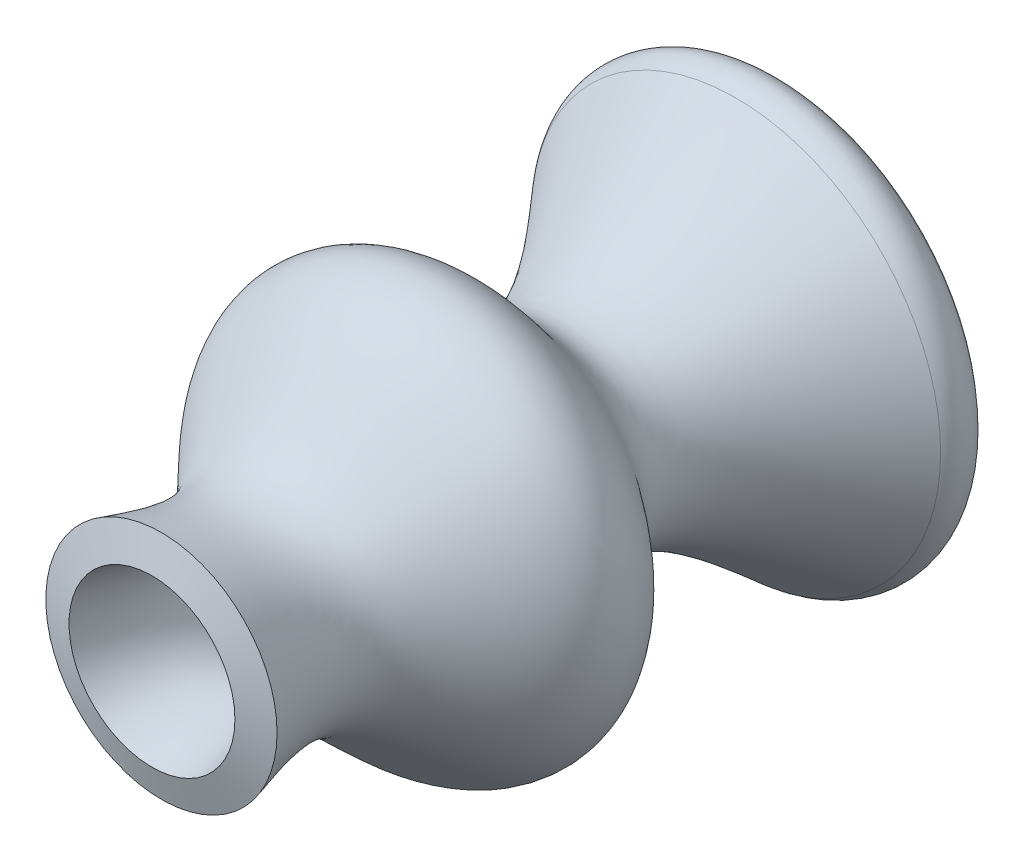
ISO-10303-21;
HEADER;
FILE_DESCRIPTION(('STEP AP214'),'2;1');
FILE_NAME('part.step','',(''),(''),'','','');
FILE_SCHEMA(('AUTOMOTIVE_DESIGN { 1 0 10303 214 1 1 1 1 }'));
ENDSEC;
DATA;
#1=APPLICATION_CONTEXT('core data for automotive mechanical design processes');
#2=APPLICATION_PROTOCOL_DEFINITION('international standard','automotive_design',2000,#1);
#3=PRODUCT_CONTEXT('',#1,'mechanical');
#4=PRODUCT('Part','Part','',(#3));
#5=PRODUCT_RELATED_PRODUCT_CATEGORY('part','',(#4));
#6=PRODUCT_DEFINITION_FORMATION('','',#4);
#7=PRODUCT_DEFINITION_CONTEXT('part definition',#1,'design');
#8=PRODUCT_DEFINITION('design','',#6,#7);
#9=PRODUCT_DEFINITION_SHAPE('','',#8);
#10=(LENGTH_UNIT() NAMED_UNIT(*) SI_UNIT(.MILLI.,.METRE.));
#11=(NAMED_UNIT(*) PLANE_ANGLE_UNIT() SI_UNIT($,.RADIAN.));
#12=(NAMED_UNIT(*) SI_UNIT($,.STERADIAN.) SOLID_ANGLE_UNIT());
#13=UNCERTAINTY_MEASURE_WITH_UNIT(LENGTH_MEASURE(1.E-05),#10,'distance_accuracy_value','');
#14=(GEOMETRIC_REPRESENTATION_CONTEXT(3) GLOBAL_UNCERTAINTY_ASSIGNED_CONTEXT((#13)) GLOBAL_UNIT_ASSIGNED_CONTEXT((#10,
#11,#12)) REPRESENTATION_CONTEXT('',''));
#15=CARTESIAN_POINT('',(0.,0.,0.));
#16=DIRECTION('',(0.,0.,1.));
#17=DIRECTION('',(1.,0.,0.));
#18=AXIS2_PLACEMENT_3D('',#15,#16,#17);
#19=CARTESIAN_POINT('',(0.,29.2553920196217,0.));
#20=CARTESIAN_POINT('',(0.,24.3169348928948,-17.027079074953));
#21=CARTESIAN_POINT('',(0.,13.618982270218,-53.9120576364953));
#22=CARTESIAN_POINT('',(0.,82.4425890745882,-94.4498861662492));
#23=CARTESIAN_POINT('',(0.,-4.19776380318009,-137.357554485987));
#24=CARTESIAN_POINT('',(0.,38.8548860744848,-186.226229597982));
#25=CARTESIAN_POINT('',(0.,69.7961930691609,-221.347428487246));
#26=B_SPLINE_CURVE_WITH_KNOTS('',3,(#19,#20,#21,#22,#23,#24,#25),.UNSPECIFIED.,.F.,.F.,(4,1,1,1,
4),(0.,0.197161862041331,0.427102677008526,0.588267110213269,1.),.UNSPECIFIED.);
#27=CARTESIAN_POINT('',(0.,0.,0.));
#28=DIRECTION('',(0.,0.,1.));
#29=AXIS1_PLACEMENT('',#27,#28);
#30=SURFACE_OF_REVOLUTION('',#26,#29);
#31=CARTESIAN_POINT('',(0.,0.,-221.347428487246));
#32=DIRECTION('',(0.,0.,1.));
#33=DIRECTION('',(1.,0.,0.));
#34=AXIS2_PLACEMENT_3D('',#31,#32,#33);
#35=CIRCLE('',#34,69.7961930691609);
#36=CARTESIAN_POINT('',(69.7961930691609,0.,-221.347428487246));
#37=VERTEX_POINT('',#36);
#38=EDGE_CURVE('E51',#37,#37,#35,.T.);
#39=ORIENTED_EDGE('',*,*,#38,.F.);
#40=EDGE_LOOP('',(#39));
#41=FACE_BOUND('',#40,.T.);
#42=CARTESIAN_POINT('',(0.,0.,0.));
#43=DIRECTION('',(0.,0.,1.));
#44=DIRECTION('',(1.,0.,0.));
#45=AXIS2_PLACEMENT_3D('',#42,#43,#44);
#46=CIRCLE('',#45,29.2553920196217);
#47=CARTESIAN_POINT('',(29.2553920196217,0.,0.));
#48=VERTEX_POINT('',#47);
#49=EDGE_CURVE('E42',#48,#48,#46,.T.);
#50=ORIENTED_EDGE('',*,*,#49,.T.);
#51=EDGE_LOOP('',(#50));
#52=FACE_BOUND('',#51,.T.);
#53=ADVANCED_FACE('F31',(#41,#52),#30,.T.);
#54=CARTESIAN_POINT('',(0.,0.,0.));
#55=DIRECTION('',(0.,0.,-1.));
#56=DIRECTION('',(-1.,0.,0.));
#57=AXIS2_PLACEMENT_3D('',#54,#55,#56);
#58=CONICAL_SURFACE('',#57,29.2553920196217,1.2885061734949);
#59=CARTESIAN_POINT('',(0.,0.,-3.34267063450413));
#60=DIRECTION('',(0.,0.,1.));
#61=DIRECTION('',(1.,0.,0.));
#62=AXIS2_PLACEMENT_3D('',#59,#60,#61);
#63=CIRCLE('',#62,40.7804322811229);
#64=CARTESIAN_POINT('',(40.7804322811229,0.,-3.34267063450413));
#65=VERTEX_POINT('',#64);
#66=EDGE_CURVE('E46',#65,#65,#63,.T.);
#67=ORIENTED_EDGE('',*,*,#66,.T.);
#68=EDGE_LOOP('',(#67));
#69=FACE_BOUND('',#68,.T.);
#70=ORIENTED_EDGE('',*,*,#49,.F.);
#71=EDGE_LOOP('',(#70));
#72=FACE_BOUND('',#71,.T.);
#73=ADVANCED_FACE('F70',(#69,#72),#58,.T.);
#74=CARTESIAN_POINT('',(0.,40.7804322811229,-3.34267063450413));
#75=CARTESIAN_POINT('',(0.,39.99769071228,-6.04144927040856));
#76=CARTESIAN_POINT('',(0.,39.2342993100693,-8.67566775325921));
#77=CARTESIAN_POINT('',(0.,37.8439476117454,-13.794823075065));
#78=CARTESIAN_POINT('',(0.,37.2172218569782,-16.2796161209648));
#79=CARTESIAN_POINT('',(0.,36.1844300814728,-21.0663410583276));
#80=CARTESIAN_POINT('',(0.,35.7787540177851,-23.3677027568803));
#81=CARTESIAN_POINT('',(0.,35.2488640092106,-27.7498856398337));
#82=CARTESIAN_POINT('',(0.,35.1246241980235,-29.829294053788));
#83=CARTESIAN_POINT('',(0.,35.1864002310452,-33.7542083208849));
#84=CARTESIAN_POINT('',(0.,35.3706299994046,-35.5982109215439));
#85=CARTESIAN_POINT('',(0.,36.0680348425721,-39.1126288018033));
#86=CARTESIAN_POINT('',(0.,36.5783556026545,-40.7847744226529));
#87=CARTESIAN_POINT('',(0.,37.4758008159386,-42.8565704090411));
#88=CARTESIAN_POINT('',(0.,37.6685417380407,-43.2700903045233));
#89=CARTESIAN_POINT('',(0.,37.9794471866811,-43.8907908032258));
#90=CARTESIAN_POINT('',(0.,38.0863851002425,-44.0971106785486));
#91=CARTESIAN_POINT('',(0.,38.3118654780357,-44.5178613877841));
#92=CARTESIAN_POINT('',(0.,38.4299412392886,-44.7313904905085));
#93=CARTESIAN_POINT('',(0.,39.0467500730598,-45.8137085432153));
#94=CARTESIAN_POINT('',(0.,39.62531088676,-46.7263643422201));
#95=CARTESIAN_POINT('',(0.,41.5921292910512,-49.5646499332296));
#96=CARTESIAN_POINT('',(0.,43.2126235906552,-51.5869065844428));
#97=CARTESIAN_POINT('',(0.,46.8511111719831,-55.7520154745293));
#98=CARTESIAN_POINT('',(0.,48.8667755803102,-57.895795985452));
#99=CARTESIAN_POINT('',(0.,53.0513670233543,-62.2593958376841));
#100=CARTESIAN_POINT('',(0.,55.2197373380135,-64.4788919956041));
#101=CARTESIAN_POINT('',(0.,58.4219932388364,-67.8903217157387));
#102=CARTESIAN_POINT('',(0.,59.4812614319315,-69.0417802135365));
#103=CARTESIAN_POINT('',(0.,61.5583777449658,-71.3882426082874));
#104=CARTESIAN_POINT('',(0.,62.5763271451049,-72.5830769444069));
#105=CARTESIAN_POINT('',(0.,64.5456296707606,-75.0426148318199));
#106=CARTESIAN_POINT('',(0.,65.4973045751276,-76.3071048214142));
#107=CARTESIAN_POINT('',(0.,67.3031257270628,-78.9498596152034));
#108=CARTESIAN_POINT('',(0.,68.1581024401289,-80.3281649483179));
#109=CARTESIAN_POINT('',(0.,69.7177933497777,-83.2643649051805));
#110=CARTESIAN_POINT('',(0.,70.4238973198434,-84.8237439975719));
#111=CARTESIAN_POINT('',(0.,71.2887970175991,-87.3506291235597));
#112=CARTESIAN_POINT('',(0.,71.5440933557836,-88.2241480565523));
#113=CARTESIAN_POINT('',(0.,71.9668508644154,-90.0359229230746));
#114=CARTESIAN_POINT('',(0.,72.1341950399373,-90.9743447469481));
#115=CARTESIAN_POINT('',(0.,72.3553762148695,-92.9084519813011));
#116=CARTESIAN_POINT('',(0.,72.408963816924,-93.904203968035));
#117=CARTESIAN_POINT('',(0.,72.3786251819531,-95.9314227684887));
#118=CARTESIAN_POINT('',(0.,72.2944200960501,-96.9627174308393));
#119=CARTESIAN_POINT('',(0.,72.0545852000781,-98.5105637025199));
#120=CARTESIAN_POINT('',(0.,71.9558286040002,-99.0265804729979));
#121=CARTESIAN_POINT('',(0.,71.7205212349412,-100.05395847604));
#122=CARTESIAN_POINT('',(0.,71.5836347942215,-100.565179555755));
#123=CARTESIAN_POINT('',(0.,71.1305632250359,-102.051490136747));
#124=CARTESIAN_POINT('',(0.,70.769975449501,-102.99098302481));
#125=CARTESIAN_POINT('',(0.,69.9697472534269,-104.768009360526));
#126=CARTESIAN_POINT('',(0.,69.5301719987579,-105.605908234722));
#127=CARTESIAN_POINT('',(0.,68.599318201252,-107.193642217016));
#128=CARTESIAN_POINT('',(0.,68.1079472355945,-107.943701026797));
#129=CARTESIAN_POINT('',(0.,66.5817691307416,-110.087318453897));
#130=CARTESIAN_POINT('',(0.,65.496463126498,-111.376048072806));
#131=CARTESIAN_POINT('',(0.,63.2566624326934,-113.784913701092));
#132=CARTESIAN_POINT('',(0.,62.1005222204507,-114.904828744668));
#133=CARTESIAN_POINT('',(0.,59.7493456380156,-117.043861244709));
#134=CARTESIAN_POINT('',(0.,58.5538407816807,-118.062463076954));
#135=CARTESIAN_POINT('',(0.,56.1531777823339,-120.03561057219));
#136=CARTESIAN_POINT('',(0.,54.9479275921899,-120.989852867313));
#137=CARTESIAN_POINT('',(0.,52.5618528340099,-122.853362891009));
#138=CARTESIAN_POINT('',(0.,51.3810282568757,-123.762506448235));
#139=CARTESIAN_POINT('',(0.,49.0832705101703,-125.543452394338));
#140=CARTESIAN_POINT('',(0.,47.9663601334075,-126.415256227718));
#141=CARTESIAN_POINT('',(0.,45.8407691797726,-128.119377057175));
#142=CARTESIAN_POINT('',(0.,44.8321496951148,-128.951806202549));
#143=CARTESIAN_POINT('',(0.,42.9712188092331,-130.563520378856));
#144=CARTESIAN_POINT('',(0.,42.1191060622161,-131.343024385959));
#145=CARTESIAN_POINT('',(0.,40.9944902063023,-132.449783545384));
#146=CARTESIAN_POINT('',(0.,40.645198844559,-132.808134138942));
#147=CARTESIAN_POINT('',(0.,40.1635632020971,-133.325334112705));
#148=CARTESIAN_POINT('',(0.,40.0109048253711,-133.493402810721));
#149=CARTESIAN_POINT('',(0.,39.714326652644,-133.82835047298));
#150=CARTESIAN_POINT('',(0.,39.5706613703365,-133.994938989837));
#151=CARTESIAN_POINT('',(0.,38.3178284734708,-135.48620173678));
#152=CARTESIAN_POINT('',(0.,37.4898803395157,-136.74969283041));
#153=CARTESIAN_POINT('',(0.,36.2289840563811,-139.209523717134));
#154=CARTESIAN_POINT('',(0.,35.7922350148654,-140.408404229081));
#155=CARTESIAN_POINT('',(0.,35.1976054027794,-142.898644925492));
#156=CARTESIAN_POINT('',(0.,35.0407495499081,-144.194544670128));
#157=CARTESIAN_POINT('',(0.,35.0156224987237,-147.017544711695));
#158=CARTESIAN_POINT('',(0.,35.1505973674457,-148.544773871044));
#159=CARTESIAN_POINT('',(0.,35.7622321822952,-151.861952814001));
#160=CARTESIAN_POINT('',(0.,36.2399246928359,-153.649984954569));
#161=CARTESIAN_POINT('',(0.,37.5583142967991,-157.453322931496));
#162=CARTESIAN_POINT('',(0.,38.398659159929,-159.467499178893));
#163=CARTESIAN_POINT('',(0.,40.4267955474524,-163.67400009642));
#164=CARTESIAN_POINT('',(0.,41.6141231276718,-165.866010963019));
#165=CARTESIAN_POINT('',(0.,44.2998981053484,-170.386027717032));
#166=CARTESIAN_POINT('',(0.,45.7980716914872,-172.714037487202));
#167=CARTESIAN_POINT('',(0.,49.060162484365,-177.473783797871));
#168=CARTESIAN_POINT('',(0.,50.8239507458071,-179.90559303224));
#169=CARTESIAN_POINT('',(0.,56.4409840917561,-187.320177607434));
#170=CARTESIAN_POINT('',(0.,60.6196079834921,-192.420309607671));
#171=CARTESIAN_POINT('',(0.,69.451025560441,-202.801573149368));
#172=CARTESIAN_POINT('',(0.,74.1035367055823,-208.083580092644));
#173=CARTESIAN_POINT('',(0.,78.8003480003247,-213.414888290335));
#174=B_SPLINE_CURVE_WITH_KNOTS('',3,(#74,#75,#76,#77,#78,#79,#80,#81,#82,#83,#84,#85,#86,#87,
#88,#89,#90,#91,#92,#93,#94,#95,#96,#97,#98,#99,#100,#101,#102,#103,#104,#105,#106,#107,#108,
#109,#110,#111,#112,#113,#114,#115,#116,#117,#118,#119,#120,#121,#122,#123,#124,#125,#126,#127,
#128,#129,#130,#131,#132,#133,#134,#135,#136,#137,#138,#139,#140,#141,#142,#143,#144,#145,#146,
#147,#148,#149,#150,#151,#152,#153,#154,#155,#156,#157,#158,#159,#160,#161,#162,#163,#164,#165,
#166,#167,#168,#169,#170,#171,#172,#173),.UNSPECIFIED.,.F.,.F.,(4,2,2,2,2,2,2,2,2,2,2,2,2,2,2,2,
2,2,2,2,2,2,2,2,2,2,2,2,2,2,2,2,2,2,2,2,2,2,2,2,2,2,2,2,2,2,2,2,2,4),(0.,0.0312499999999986,
0.0624999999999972,0.0937499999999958,0.124999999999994,0.156249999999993,0.187499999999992,
0.195312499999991,0.199218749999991,0.203124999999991,0.218749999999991,0.249999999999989,
0.281249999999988,0.312499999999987,0.328124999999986,0.343749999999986,0.359374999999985,
0.374999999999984,0.390624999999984,0.398437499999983,0.406249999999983,0.414062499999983,
0.421874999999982,0.425781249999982,0.429687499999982,0.437499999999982,0.445312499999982,
0.453124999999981,0.468749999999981,0.48437499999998,0.499999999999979,0.515624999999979,
0.531249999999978,0.546874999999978,0.562499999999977,0.578124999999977,0.585937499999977,
0.589843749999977,0.593749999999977,0.624999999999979,0.65624999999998,0.687499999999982,
0.718749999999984,0.749999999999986,0.781249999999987,0.812499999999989,0.843749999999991,
0.874999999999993,0.937499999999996,1.),.UNSPECIFIED.);
#175=CARTESIAN_POINT('',(0.,0.,0.));
#176=DIRECTION('',(0.,0.,1.));
#177=AXIS1_PLACEMENT('',#175,#176);
#178=SURFACE_OF_REVOLUTION('',#174,#177);
#179=CARTESIAN_POINT('',(0.,0.,-205.931391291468));
#180=DIRECTION('',(0.,0.,1.));
#181=DIRECTION('',(1.,0.,0.));
#182=AXIS2_PLACEMENT_3D('',#179,#180,#181);
#183=CIRCLE('',#182,72.2242217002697);
#184=CARTESIAN_POINT('',(72.2242217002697,0.,-205.931391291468));
#185=VERTEX_POINT('',#184);
#186=EDGE_CURVE('E38',#185,#185,#183,.T.);
#187=ORIENTED_EDGE('',*,*,#186,.T.);
#188=EDGE_LOOP('',(#187));
#189=FACE_BOUND('',#188,.T.);
#190=ORIENTED_EDGE('',*,*,#66,.F.);
#191=EDGE_LOOP('',(#190));
#192=FACE_BOUND('',#191,.T.);
#193=ADVANCED_FACE('F65',(#189,#192),#178,.F.);
#194=CARTESIAN_POINT('',(0.,0.,-213.414888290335));
#195=DIRECTION('',(0.,0.,1.));
#196=DIRECTION('',(1.,0.,0.));
#197=AXIS2_PLACEMENT_3D('',#194,#195,#196);
#198=CONICAL_SURFACE('',#197,78.8003480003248,0.848585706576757);
#199=CARTESIAN_POINT('',(0.,0.,-220.016990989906));
#200=DIRECTION('',(0.,0.,-1.));
#201=DIRECTION('',(-1.,0.,0.));
#202=AXIS2_PLACEMENT_3D('',#199,#200,#201);
#203=CIRCLE('',#202,71.3063606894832);
#204=CARTESIAN_POINT('',(-71.3063606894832,0.,-220.016990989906));
#205=VERTEX_POINT('',#204);
#206=EDGE_CURVE('E10',#205,#205,#203,.T.);
#207=ORIENTED_EDGE('',*,*,#206,.T.);
#208=EDGE_LOOP('',(#207));
#209=FACE_BOUND('',#208,.T.);
#210=ORIENTED_EDGE('',*,*,#38,.T.);
#211=EDGE_LOOP('',(#210));
#212=FACE_BOUND('',#211,.T.);
#213=ADVANCED_FACE('F69',(#209,#212),#198,.T.);
#214=CARTESIAN_POINT('',(0.,0.,-212.513528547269));
#215=DIRECTION('',(0.,0.,-1.));
#216=DIRECTION('',(-1.,0.,0.));
#217=AXIS2_PLACEMENT_3D('',#214,#215,#216);
#218=TOROIDAL_SURFACE('',#217,64.6959105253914,10.);
#219=ORIENTED_EDGE('',*,*,#206,.F.);
#220=EDGE_LOOP('',(#219));
#221=FACE_BOUND('',#220,.T.);
#222=ORIENTED_EDGE('',*,*,#186,.F.);
#223=EDGE_LOOP('',(#222));
#224=FACE_BOUND('',#223,.T.);
#225=ADVANCED_FACE('F33',(#221,#224),#218,.T.);
#226=CLOSED_SHELL('',(#53,#73,#193,#213,#225));
#227=MANIFOLD_SOLID_BREP('B2',#226);
#228=ADVANCED_BREP_SHAPE_REPRESENTATION('',(#18,#227),#14);
#229=SHAPE_DEFINITION_REPRESENTATION(#9,#228);
ENDSEC;
END-ISO-10303-21;
